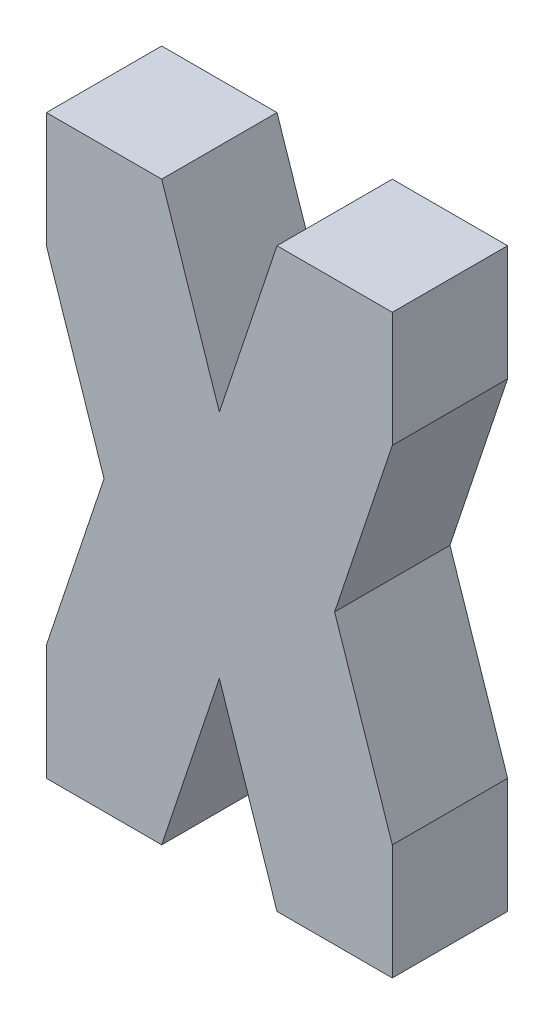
ISO-10303-21;
HEADER;
FILE_DESCRIPTION(('STEP AP214'),'2;1');
FILE_NAME('part.step','',(''),(''),'','','');
FILE_SCHEMA(('AUTOMOTIVE_DESIGN { 1 0 10303 214 1 1 1 1 }'));
ENDSEC;
DATA;
#1=APPLICATION_CONTEXT('core data for automotive mechanical design processes');
#2=APPLICATION_PROTOCOL_DEFINITION('international standard','automotive_design',2000,#1);
#3=PRODUCT_CONTEXT('',#1,'mechanical');
#4=PRODUCT('Part','Part','',(#3));
#5=PRODUCT_RELATED_PRODUCT_CATEGORY('part','',(#4));
#6=PRODUCT_DEFINITION_FORMATION('','',#4);
#7=PRODUCT_DEFINITION_CONTEXT('part definition',#1,'design');
#8=PRODUCT_DEFINITION('design','',#6,#7);
#9=PRODUCT_DEFINITION_SHAPE('','',#8);
#10=(LENGTH_UNIT() NAMED_UNIT(*) SI_UNIT(.MILLI.,.METRE.));
#11=(NAMED_UNIT(*) PLANE_ANGLE_UNIT() SI_UNIT($,.RADIAN.));
#12=(NAMED_UNIT(*) SI_UNIT($,.STERADIAN.) SOLID_ANGLE_UNIT());
#13=UNCERTAINTY_MEASURE_WITH_UNIT(LENGTH_MEASURE(1.E-05),#10,'distance_accuracy_value','');
#14=(GEOMETRIC_REPRESENTATION_CONTEXT(3) GLOBAL_UNCERTAINTY_ASSIGNED_CONTEXT((#13)) GLOBAL_UNIT_ASSIGNED_CONTEXT((#10,
#11,#12)) REPRESENTATION_CONTEXT('',''));
#15=CARTESIAN_POINT('',(0.,0.,0.));
#16=DIRECTION('',(0.,0.,1.));
#17=DIRECTION('',(1.,0.,0.));
#18=AXIS2_PLACEMENT_3D('',#15,#16,#17);
#19=CARTESIAN_POINT('',(0.,0.,10.));
#20=DIRECTION('',(1.,0.,0.));
#21=DIRECTION('',(0.,0.,-1.));
#22=AXIS2_PLACEMENT_3D('',#19,#20,#21);
#23=PLANE('',#22);
#24=DIRECTION('',(0.,-1.,0.));
#25=VECTOR('',#24,1.);
#26=CARTESIAN_POINT('',(0.,0.,0.));
#27=LINE('',#26,#25);
#28=CARTESIAN_POINT('',(0.,10.,0.));
#29=VERTEX_POINT('',#28);
#30=CARTESIAN_POINT('',(0.,0.,0.));
#31=VERTEX_POINT('',#30);
#32=EDGE_CURVE('E177',#29,#31,#27,.T.);
#33=ORIENTED_EDGE('',*,*,#32,.T.);
#34=DIRECTION('',(0.,0.,-1.));
#35=VECTOR('',#34,1.);
#36=CARTESIAN_POINT('',(0.,0.,10.));
#37=LINE('',#36,#35);
#38=CARTESIAN_POINT('',(0.,0.,10.));
#39=VERTEX_POINT('',#38);
#40=EDGE_CURVE('E11',#39,#31,#37,.T.);
#41=ORIENTED_EDGE('',*,*,#40,.F.);
#42=DIRECTION('',(0.,-1.,0.));
#43=VECTOR('',#42,1.);
#44=CARTESIAN_POINT('',(0.,0.,10.));
#45=LINE('',#44,#43);
#46=CARTESIAN_POINT('',(0.,10.,10.));
#47=VERTEX_POINT('',#46);
#48=EDGE_CURVE('E207',#47,#39,#45,.T.);
#49=ORIENTED_EDGE('',*,*,#48,.F.);
#50=DIRECTION('',(0.,0.,-1.));
#51=VECTOR('',#50,1.);
#52=CARTESIAN_POINT('',(0.,10.,10.));
#53=LINE('',#52,#51);
#54=EDGE_CURVE('E173',#47,#29,#53,.T.);
#55=ORIENTED_EDGE('',*,*,#54,.T.);
#56=EDGE_LOOP('',(#33,#41,#49,#55));
#57=FACE_BOUND('',#56,.T.);
#58=ADVANCED_FACE('F33',(#57),#23,.F.);
#59=CARTESIAN_POINT('',(0.,0.,10.));
#60=DIRECTION('',(0.,1.,0.));
#61=DIRECTION('',(0.,0.,1.));
#62=AXIS2_PLACEMENT_3D('',#59,#60,#61);
#63=PLANE('',#62);
#64=DIRECTION('',(1.,0.,0.));
#65=VECTOR('',#64,1.);
#66=CARTESIAN_POINT('',(0.,0.,0.));
#67=LINE('',#66,#65);
#68=CARTESIAN_POINT('',(10.,0.,0.));
#69=VERTEX_POINT('',#68);
#70=EDGE_CURVE('E180',#31,#69,#67,.T.);
#71=ORIENTED_EDGE('',*,*,#70,.T.);
#72=DIRECTION('',(0.,0.,-1.));
#73=VECTOR('',#72,1.);
#74=CARTESIAN_POINT('',(10.,0.,10.));
#75=LINE('',#74,#73);
#76=CARTESIAN_POINT('',(10.,0.,10.));
#77=VERTEX_POINT('',#76);
#78=EDGE_CURVE('E41',#77,#69,#75,.T.);
#79=ORIENTED_EDGE('',*,*,#78,.F.);
#80=DIRECTION('',(1.,0.,0.));
#81=VECTOR('',#80,1.);
#82=CARTESIAN_POINT('',(0.,0.,10.));
#83=LINE('',#82,#81);
#84=EDGE_CURVE('E116',#39,#77,#83,.T.);
#85=ORIENTED_EDGE('',*,*,#84,.F.);
#86=ORIENTED_EDGE('',*,*,#40,.T.);
#87=EDGE_LOOP('',(#71,#79,#85,#86));
#88=FACE_BOUND('',#87,.T.);
#89=ADVANCED_FACE('F305',(#88),#63,.F.);
#90=CARTESIAN_POINT('',(10.,0.,10.));
#91=DIRECTION('',(-0.948683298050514,0.316227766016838,0.));
#92=DIRECTION('',(-0.316227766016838,-0.948683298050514,0.));
#93=AXIS2_PLACEMENT_3D('',#90,#91,#92);
#94=PLANE('',#93);
#95=DIRECTION('',(0.316227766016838,0.948683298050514,0.));
#96=VECTOR('',#95,1.);
#97=CARTESIAN_POINT('',(10.,0.,0.));
#98=LINE('',#97,#96);
#99=CARTESIAN_POINT('',(15.,15.,0.));
#100=VERTEX_POINT('',#99);
#101=EDGE_CURVE('E182',#69,#100,#98,.T.);
#102=ORIENTED_EDGE('',*,*,#101,.T.);
#103=DIRECTION('',(0.,0.,-1.));
#104=VECTOR('',#103,1.);
#105=CARTESIAN_POINT('',(15.,15.,10.));
#106=LINE('',#105,#104);
#107=CARTESIAN_POINT('',(15.,15.,10.));
#108=VERTEX_POINT('',#107);
#109=EDGE_CURVE('E238',#108,#100,#106,.T.);
#110=ORIENTED_EDGE('',*,*,#109,.F.);
#111=DIRECTION('',(0.316227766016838,0.948683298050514,0.));
#112=VECTOR('',#111,1.);
#113=CARTESIAN_POINT('',(10.,0.,10.));
#114=LINE('',#113,#112);
#115=EDGE_CURVE('E246',#77,#108,#114,.T.);
#116=ORIENTED_EDGE('',*,*,#115,.F.);
#117=ORIENTED_EDGE('',*,*,#78,.T.);
#118=EDGE_LOOP('',(#102,#110,#116,#117));
#119=FACE_BOUND('',#118,.T.);
#120=ADVANCED_FACE('F244',(#119),#94,.F.);
#121=CARTESIAN_POINT('',(15.,15.,10.));
#122=DIRECTION('',(0.948683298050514,0.316227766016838,0.));
#123=DIRECTION('',(-0.316227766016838,0.948683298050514,0.));
#124=AXIS2_PLACEMENT_3D('',#121,#122,#123);
#125=PLANE('',#124);
#126=DIRECTION('',(0.316227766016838,-0.948683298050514,0.));
#127=VECTOR('',#126,1.);
#128=CARTESIAN_POINT('',(15.,15.,0.));
#129=LINE('',#128,#127);
#130=CARTESIAN_POINT('',(20.,0.,0.));
#131=VERTEX_POINT('',#130);
#132=EDGE_CURVE('E184',#100,#131,#129,.T.);
#133=ORIENTED_EDGE('',*,*,#132,.T.);
#134=DIRECTION('',(0.,0.,-1.));
#135=VECTOR('',#134,1.);
#136=CARTESIAN_POINT('',(20.,0.,10.));
#137=LINE('',#136,#135);
#138=CARTESIAN_POINT('',(20.,0.,10.));
#139=VERTEX_POINT('',#138);
#140=EDGE_CURVE('E235',#139,#131,#137,.T.);
#141=ORIENTED_EDGE('',*,*,#140,.F.);
#142=DIRECTION('',(0.316227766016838,-0.948683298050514,0.));
#143=VECTOR('',#142,1.);
#144=CARTESIAN_POINT('',(15.,15.,10.));
#145=LINE('',#144,#143);
#146=EDGE_CURVE('E264',#108,#139,#145,.T.);
#147=ORIENTED_EDGE('',*,*,#146,.F.);
#148=ORIENTED_EDGE('',*,*,#109,.T.);
#149=EDGE_LOOP('',(#133,#141,#147,#148));
#150=FACE_BOUND('',#149,.T.);
#151=ADVANCED_FACE('F255',(#150),#125,.F.);
#152=CARTESIAN_POINT('',(20.,0.,10.));
#153=DIRECTION('',(0.,1.,0.));
#154=DIRECTION('',(0.,0.,1.));
#155=AXIS2_PLACEMENT_3D('',#152,#153,#154);
#156=PLANE('',#155);
#157=DIRECTION('',(1.,0.,0.));
#158=VECTOR('',#157,1.);
#159=CARTESIAN_POINT('',(20.,0.,0.));
#160=LINE('',#159,#158);
#161=CARTESIAN_POINT('',(30.,0.,0.));
#162=VERTEX_POINT('',#161);
#163=EDGE_CURVE('E186',#131,#162,#160,.T.);
#164=ORIENTED_EDGE('',*,*,#163,.T.);
#165=DIRECTION('',(0.,0.,-1.));
#166=VECTOR('',#165,1.);
#167=CARTESIAN_POINT('',(30.,0.,10.));
#168=LINE('',#167,#166);
#169=CARTESIAN_POINT('',(30.,0.,10.));
#170=VERTEX_POINT('',#169);
#171=EDGE_CURVE('E232',#170,#162,#168,.T.);
#172=ORIENTED_EDGE('',*,*,#171,.F.);
#173=DIRECTION('',(1.,0.,0.));
#174=VECTOR('',#173,1.);
#175=CARTESIAN_POINT('',(20.,0.,10.));
#176=LINE('',#175,#174);
#177=EDGE_CURVE('E261',#139,#170,#176,.T.);
#178=ORIENTED_EDGE('',*,*,#177,.F.);
#179=ORIENTED_EDGE('',*,*,#140,.T.);
#180=EDGE_LOOP('',(#164,#172,#178,#179));
#181=FACE_BOUND('',#180,.T.);
#182=ADVANCED_FACE('F259',(#181),#156,.F.);
#183=CARTESIAN_POINT('',(30.,0.,10.));
#184=DIRECTION('',(-1.,0.,0.));
#185=DIRECTION('',(0.,0.,1.));
#186=AXIS2_PLACEMENT_3D('',#183,#184,#185);
#187=PLANE('',#186);
#188=DIRECTION('',(0.,1.,0.));
#189=VECTOR('',#188,1.);
#190=CARTESIAN_POINT('',(30.,0.,0.));
#191=LINE('',#190,#189);
#192=CARTESIAN_POINT('',(30.,10.,0.));
#193=VERTEX_POINT('',#192);
#194=EDGE_CURVE('E188',#162,#193,#191,.T.);
#195=ORIENTED_EDGE('',*,*,#194,.T.);
#196=DIRECTION('',(0.,0.,-1.));
#197=VECTOR('',#196,1.);
#198=CARTESIAN_POINT('',(30.,10.,10.));
#199=LINE('',#198,#197);
#200=CARTESIAN_POINT('',(30.,10.,10.));
#201=VERTEX_POINT('',#200);
#202=EDGE_CURVE('E229',#201,#193,#199,.T.);
#203=ORIENTED_EDGE('',*,*,#202,.F.);
#204=DIRECTION('',(0.,1.,0.));
#205=VECTOR('',#204,1.);
#206=CARTESIAN_POINT('',(30.,0.,10.));
#207=LINE('',#206,#205);
#208=EDGE_CURVE('E263',#170,#201,#207,.T.);
#209=ORIENTED_EDGE('',*,*,#208,.F.);
#210=ORIENTED_EDGE('',*,*,#171,.T.);
#211=EDGE_LOOP('',(#195,#203,#209,#210));
#212=FACE_BOUND('',#211,.T.);
#213=ADVANCED_FACE('F318',(#212),#187,.F.);
#214=CARTESIAN_POINT('',(25.,25.,10.));
#215=DIRECTION('',(-0.948683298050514,-0.316227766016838,0.));
#216=DIRECTION('',(0.316227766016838,-0.948683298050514,0.));
#217=AXIS2_PLACEMENT_3D('',#214,#215,#216);
#218=PLANE('',#217);
#219=DIRECTION('',(-0.316227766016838,0.948683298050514,0.));
#220=VECTOR('',#219,1.);
#221=CARTESIAN_POINT('',(25.,25.,0.));
#222=LINE('',#221,#220);
#223=CARTESIAN_POINT('',(25.,25.,0.));
#224=VERTEX_POINT('',#223);
#225=EDGE_CURVE('E190',#193,#224,#222,.T.);
#226=ORIENTED_EDGE('',*,*,#225,.T.);
#227=DIRECTION('',(0.,0.,-1.));
#228=VECTOR('',#227,1.);
#229=CARTESIAN_POINT('',(25.,25.,10.));
#230=LINE('',#229,#228);
#231=CARTESIAN_POINT('',(25.,25.,10.));
#232=VERTEX_POINT('',#231);
#233=EDGE_CURVE('E226',#232,#224,#230,.T.);
#234=ORIENTED_EDGE('',*,*,#233,.F.);
#235=DIRECTION('',(-0.316227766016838,0.948683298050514,0.));
#236=VECTOR('',#235,1.);
#237=CARTESIAN_POINT('',(25.,25.,10.));
#238=LINE('',#237,#236);
#239=EDGE_CURVE('E266',#201,#232,#238,.T.);
#240=ORIENTED_EDGE('',*,*,#239,.F.);
#241=ORIENTED_EDGE('',*,*,#202,.T.);
#242=EDGE_LOOP('',(#226,#234,#240,#241));
#243=FACE_BOUND('',#242,.T.);
#244=ADVANCED_FACE('F321',(#243),#218,.F.);
#245=CARTESIAN_POINT('',(30.,40.,10.));
#246=DIRECTION('',(-0.948683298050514,0.316227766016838,0.));
#247=DIRECTION('',(-0.316227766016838,-0.948683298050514,0.));
#248=AXIS2_PLACEMENT_3D('',#245,#246,#247);
#249=PLANE('',#248);
#250=DIRECTION('',(0.316227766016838,0.948683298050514,0.));
#251=VECTOR('',#250,1.);
#252=CARTESIAN_POINT('',(30.,40.,0.));
#253=LINE('',#252,#251);
#254=CARTESIAN_POINT('',(30.,40.,0.));
#255=VERTEX_POINT('',#254);
#256=EDGE_CURVE('E192',#224,#255,#253,.T.);
#257=ORIENTED_EDGE('',*,*,#256,.T.);
#258=DIRECTION('',(0.,0.,-1.));
#259=VECTOR('',#258,1.);
#260=CARTESIAN_POINT('',(30.,40.,10.));
#261=LINE('',#260,#259);
#262=CARTESIAN_POINT('',(30.,40.,10.));
#263=VERTEX_POINT('',#262);
#264=EDGE_CURVE('E223',#263,#255,#261,.T.);
#265=ORIENTED_EDGE('',*,*,#264,.F.);
#266=DIRECTION('',(0.316227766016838,0.948683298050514,0.));
#267=VECTOR('',#266,1.);
#268=CARTESIAN_POINT('',(30.,40.,10.));
#269=LINE('',#268,#267);
#270=EDGE_CURVE('E272',#232,#263,#269,.T.);
#271=ORIENTED_EDGE('',*,*,#270,.F.);
#272=ORIENTED_EDGE('',*,*,#233,.T.);
#273=EDGE_LOOP('',(#257,#265,#271,#272));
#274=FACE_BOUND('',#273,.T.);
#275=ADVANCED_FACE('F325',(#274),#249,.F.);
#276=CARTESIAN_POINT('',(30.,40.,10.));
#277=DIRECTION('',(-1.,0.,0.));
#278=DIRECTION('',(0.,0.,1.));
#279=AXIS2_PLACEMENT_3D('',#276,#277,#278);
#280=PLANE('',#279);
#281=DIRECTION('',(0.,1.,0.));
#282=VECTOR('',#281,1.);
#283=CARTESIAN_POINT('',(30.,40.,0.));
#284=LINE('',#283,#282);
#285=CARTESIAN_POINT('',(30.,50.,0.));
#286=VERTEX_POINT('',#285);
#287=EDGE_CURVE('E194',#255,#286,#284,.T.);
#288=ORIENTED_EDGE('',*,*,#287,.T.);
#289=DIRECTION('',(0.,0.,-1.));
#290=VECTOR('',#289,1.);
#291=CARTESIAN_POINT('',(30.,50.,10.));
#292=LINE('',#291,#290);
#293=CARTESIAN_POINT('',(30.,50.,10.));
#294=VERTEX_POINT('',#293);
#295=EDGE_CURVE('E220',#294,#286,#292,.T.);
#296=ORIENTED_EDGE('',*,*,#295,.F.);
#297=DIRECTION('',(0.,1.,0.));
#298=VECTOR('',#297,1.);
#299=CARTESIAN_POINT('',(30.,40.,10.));
#300=LINE('',#299,#298);
#301=EDGE_CURVE('E274',#263,#294,#300,.T.);
#302=ORIENTED_EDGE('',*,*,#301,.F.);
#303=ORIENTED_EDGE('',*,*,#264,.T.);
#304=EDGE_LOOP('',(#288,#296,#302,#303));
#305=FACE_BOUND('',#304,.T.);
#306=ADVANCED_FACE('F329',(#305),#280,.F.);
#307=CARTESIAN_POINT('',(20.,50.,10.));
#308=DIRECTION('',(0.,-1.,0.));
#309=DIRECTION('',(0.,0.,-1.));
#310=AXIS2_PLACEMENT_3D('',#307,#308,#309);
#311=PLANE('',#310);
#312=DIRECTION('',(-1.,0.,0.));
#313=VECTOR('',#312,1.);
#314=CARTESIAN_POINT('',(20.,50.,0.));
#315=LINE('',#314,#313);
#316=CARTESIAN_POINT('',(20.,50.,0.));
#317=VERTEX_POINT('',#316);
#318=EDGE_CURVE('E196',#286,#317,#315,.T.);
#319=ORIENTED_EDGE('',*,*,#318,.T.);
#320=DIRECTION('',(0.,0.,-1.));
#321=VECTOR('',#320,1.);
#322=CARTESIAN_POINT('',(20.,50.,10.));
#323=LINE('',#322,#321);
#324=CARTESIAN_POINT('',(20.,50.,10.));
#325=VERTEX_POINT('',#324);
#326=EDGE_CURVE('E217',#325,#317,#323,.T.);
#327=ORIENTED_EDGE('',*,*,#326,.F.);
#328=DIRECTION('',(-1.,0.,0.));
#329=VECTOR('',#328,1.);
#330=CARTESIAN_POINT('',(20.,50.,10.));
#331=LINE('',#330,#329);
#332=EDGE_CURVE('E276',#294,#325,#331,.T.);
#333=ORIENTED_EDGE('',*,*,#332,.F.);
#334=ORIENTED_EDGE('',*,*,#295,.T.);
#335=EDGE_LOOP('',(#319,#327,#333,#334));
#336=FACE_BOUND('',#335,.T.);
#337=ADVANCED_FACE('F333',(#336),#311,.F.);
#338=CARTESIAN_POINT('',(15.,35.,10.));
#339=DIRECTION('',(0.948683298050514,-0.316227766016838,0.));
#340=DIRECTION('',(0.316227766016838,0.948683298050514,0.));
#341=AXIS2_PLACEMENT_3D('',#338,#339,#340);
#342=PLANE('',#341);
#343=DIRECTION('',(-0.316227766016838,-0.948683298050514,0.));
#344=VECTOR('',#343,1.);
#345=CARTESIAN_POINT('',(15.,35.,0.));
#346=LINE('',#345,#344);
#347=CARTESIAN_POINT('',(15.,35.,0.));
#348=VERTEX_POINT('',#347);
#349=EDGE_CURVE('E198',#317,#348,#346,.T.);
#350=ORIENTED_EDGE('',*,*,#349,.T.);
#351=DIRECTION('',(0.,0.,-1.));
#352=VECTOR('',#351,1.);
#353=CARTESIAN_POINT('',(15.,35.,10.));
#354=LINE('',#353,#352);
#355=CARTESIAN_POINT('',(15.,35.,10.));
#356=VERTEX_POINT('',#355);
#357=EDGE_CURVE('E214',#356,#348,#354,.T.);
#358=ORIENTED_EDGE('',*,*,#357,.F.);
#359=DIRECTION('',(-0.316227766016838,-0.948683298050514,0.));
#360=VECTOR('',#359,1.);
#361=CARTESIAN_POINT('',(15.,35.,10.));
#362=LINE('',#361,#360);
#363=EDGE_CURVE('E278',#325,#356,#362,.T.);
#364=ORIENTED_EDGE('',*,*,#363,.F.);
#365=ORIENTED_EDGE('',*,*,#326,.T.);
#366=EDGE_LOOP('',(#350,#358,#364,#365));
#367=FACE_BOUND('',#366,.T.);
#368=ADVANCED_FACE('F337',(#367),#342,.F.);
#369=CARTESIAN_POINT('',(10.,50.,10.));
#370=DIRECTION('',(-0.948683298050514,-0.316227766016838,0.));
#371=DIRECTION('',(0.316227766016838,-0.948683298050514,0.));
#372=AXIS2_PLACEMENT_3D('',#369,#370,#371);
#373=PLANE('',#372);
#374=DIRECTION('',(-0.316227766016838,0.948683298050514,0.));
#375=VECTOR('',#374,1.);
#376=CARTESIAN_POINT('',(10.,50.,0.));
#377=LINE('',#376,#375);
#378=CARTESIAN_POINT('',(10.,50.,0.));
#379=VERTEX_POINT('',#378);
#380=EDGE_CURVE('E200',#348,#379,#377,.T.);
#381=ORIENTED_EDGE('',*,*,#380,.T.);
#382=DIRECTION('',(0.,0.,-1.));
#383=VECTOR('',#382,1.);
#384=CARTESIAN_POINT('',(10.,50.,10.));
#385=LINE('',#384,#383);
#386=CARTESIAN_POINT('',(10.,50.,10.));
#387=VERTEX_POINT('',#386);
#388=EDGE_CURVE('E211',#387,#379,#385,.T.);
#389=ORIENTED_EDGE('',*,*,#388,.F.);
#390=DIRECTION('',(-0.316227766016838,0.948683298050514,0.));
#391=VECTOR('',#390,1.);
#392=CARTESIAN_POINT('',(10.,50.,10.));
#393=LINE('',#392,#391);
#394=EDGE_CURVE('E280',#356,#387,#393,.T.);
#395=ORIENTED_EDGE('',*,*,#394,.F.);
#396=ORIENTED_EDGE('',*,*,#357,.T.);
#397=EDGE_LOOP('',(#381,#389,#395,#396));
#398=FACE_BOUND('',#397,.T.);
#399=ADVANCED_FACE('F286',(#398),#373,.F.);
#400=CARTESIAN_POINT('',(0.,50.,10.));
#401=DIRECTION('',(0.,-1.,0.));
#402=DIRECTION('',(0.,0.,-1.));
#403=AXIS2_PLACEMENT_3D('',#400,#401,#402);
#404=PLANE('',#403);
#405=DIRECTION('',(-1.,0.,0.));
#406=VECTOR('',#405,1.);
#407=CARTESIAN_POINT('',(0.,50.,0.));
#408=LINE('',#407,#406);
#409=CARTESIAN_POINT('',(0.,50.,0.));
#410=VERTEX_POINT('',#409);
#411=EDGE_CURVE('E202',#379,#410,#408,.T.);
#412=ORIENTED_EDGE('',*,*,#411,.T.);
#413=DIRECTION('',(0.,0.,-1.));
#414=VECTOR('',#413,1.);
#415=CARTESIAN_POINT('',(0.,50.,10.));
#416=LINE('',#415,#414);
#417=CARTESIAN_POINT('',(0.,50.,10.));
#418=VERTEX_POINT('',#417);
#419=EDGE_CURVE('E168',#418,#410,#416,.T.);
#420=ORIENTED_EDGE('',*,*,#419,.F.);
#421=DIRECTION('',(-1.,0.,0.));
#422=VECTOR('',#421,1.);
#423=CARTESIAN_POINT('',(0.,50.,10.));
#424=LINE('',#423,#422);
#425=EDGE_CURVE('E159',#387,#418,#424,.T.);
#426=ORIENTED_EDGE('',*,*,#425,.F.);
#427=ORIENTED_EDGE('',*,*,#388,.T.);
#428=EDGE_LOOP('',(#412,#420,#426,#427));
#429=FACE_BOUND('',#428,.T.);
#430=ADVANCED_FACE('F290',(#429),#404,.F.);
#431=CARTESIAN_POINT('',(0.,40.,10.));
#432=DIRECTION('',(1.,0.,0.));
#433=DIRECTION('',(0.,0.,-1.));
#434=AXIS2_PLACEMENT_3D('',#431,#432,#433);
#435=PLANE('',#434);
#436=DIRECTION('',(0.,-1.,0.));
#437=VECTOR('',#436,1.);
#438=CARTESIAN_POINT('',(0.,40.,0.));
#439=LINE('',#438,#437);
#440=CARTESIAN_POINT('',(0.,40.,0.));
#441=VERTEX_POINT('',#440);
#442=EDGE_CURVE('E167',#410,#441,#439,.T.);
#443=ORIENTED_EDGE('',*,*,#442,.T.);
#444=DIRECTION('',(0.,0.,-1.));
#445=VECTOR('',#444,1.);
#446=CARTESIAN_POINT('',(0.,40.,10.));
#447=LINE('',#446,#445);
#448=CARTESIAN_POINT('',(0.,40.,10.));
#449=VERTEX_POINT('',#448);
#450=EDGE_CURVE('E164',#449,#441,#447,.T.);
#451=ORIENTED_EDGE('',*,*,#450,.F.);
#452=DIRECTION('',(0.,-1.,0.));
#453=VECTOR('',#452,1.);
#454=CARTESIAN_POINT('',(0.,40.,10.));
#455=LINE('',#454,#453);
#456=EDGE_CURVE('E153',#418,#449,#455,.T.);
#457=ORIENTED_EDGE('',*,*,#456,.F.);
#458=ORIENTED_EDGE('',*,*,#419,.T.);
#459=EDGE_LOOP('',(#443,#451,#457,#458));
#460=FACE_BOUND('',#459,.T.);
#461=ADVANCED_FACE('F165',(#460),#435,.F.);
#462=CARTESIAN_POINT('',(0.,40.,10.));
#463=DIRECTION('',(0.948683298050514,0.316227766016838,0.));
#464=DIRECTION('',(-0.316227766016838,0.948683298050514,0.));
#465=AXIS2_PLACEMENT_3D('',#462,#463,#464);
#466=PLANE('',#465);
#467=DIRECTION('',(0.316227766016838,-0.948683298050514,0.));
#468=VECTOR('',#467,1.);
#469=CARTESIAN_POINT('',(0.,40.,0.));
#470=LINE('',#469,#468);
#471=CARTESIAN_POINT('',(5.,25.,0.));
#472=VERTEX_POINT('',#471);
#473=EDGE_CURVE('E102',#441,#472,#470,.T.);
#474=ORIENTED_EDGE('',*,*,#473,.T.);
#475=DIRECTION('',(0.,0.,-1.));
#476=VECTOR('',#475,1.);
#477=CARTESIAN_POINT('',(5.,25.,10.));
#478=LINE('',#477,#476);
#479=CARTESIAN_POINT('',(5.,25.,10.));
#480=VERTEX_POINT('',#479);
#481=EDGE_CURVE('E169',#480,#472,#478,.T.);
#482=ORIENTED_EDGE('',*,*,#481,.F.);
#483=DIRECTION('',(0.316227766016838,-0.948683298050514,0.));
#484=VECTOR('',#483,1.);
#485=CARTESIAN_POINT('',(0.,40.,10.));
#486=LINE('',#485,#484);
#487=EDGE_CURVE('E157',#449,#480,#486,.T.);
#488=ORIENTED_EDGE('',*,*,#487,.F.);
#489=ORIENTED_EDGE('',*,*,#450,.T.);
#490=EDGE_LOOP('',(#474,#482,#488,#489));
#491=FACE_BOUND('',#490,.T.);
#492=ADVANCED_FACE('F171',(#491),#466,.F.);
#493=CARTESIAN_POINT('',(5.,25.,10.));
#494=DIRECTION('',(0.948683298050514,-0.316227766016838,0.));
#495=DIRECTION('',(0.316227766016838,0.948683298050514,0.));
#496=AXIS2_PLACEMENT_3D('',#493,#494,#495);
#497=PLANE('',#496);
#498=DIRECTION('',(-0.316227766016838,-0.948683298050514,0.));
#499=VECTOR('',#498,1.);
#500=CARTESIAN_POINT('',(5.,25.,0.));
#501=LINE('',#500,#499);
#502=EDGE_CURVE('E108',#472,#29,#501,.T.);
#503=ORIENTED_EDGE('',*,*,#502,.T.);
#504=ORIENTED_EDGE('',*,*,#54,.F.);
#505=DIRECTION('',(-0.316227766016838,-0.948683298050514,0.));
#506=VECTOR('',#505,1.);
#507=CARTESIAN_POINT('',(5.,25.,10.));
#508=LINE('',#507,#506);
#509=EDGE_CURVE('E49',#480,#47,#508,.T.);
#510=ORIENTED_EDGE('',*,*,#509,.F.);
#511=ORIENTED_EDGE('',*,*,#481,.T.);
#512=EDGE_LOOP('',(#503,#504,#510,#511));
#513=FACE_BOUND('',#512,.T.);
#514=ADVANCED_FACE('F294',(#513),#497,.F.);
#515=CARTESIAN_POINT('',(0.,0.,10.));
#516=DIRECTION('',(0.,0.,-1.));
#517=DIRECTION('',(-1.,0.,0.));
#518=AXIS2_PLACEMENT_3D('',#515,#516,#517);
#519=PLANE('',#518);
#520=ORIENTED_EDGE('',*,*,#48,.T.);
#521=ORIENTED_EDGE('',*,*,#84,.T.);
#522=ORIENTED_EDGE('',*,*,#115,.T.);
#523=ORIENTED_EDGE('',*,*,#146,.T.);
#524=ORIENTED_EDGE('',*,*,#177,.T.);
#525=ORIENTED_EDGE('',*,*,#208,.T.);
#526=ORIENTED_EDGE('',*,*,#239,.T.);
#527=ORIENTED_EDGE('',*,*,#270,.T.);
#528=ORIENTED_EDGE('',*,*,#301,.T.);
#529=ORIENTED_EDGE('',*,*,#332,.T.);
#530=ORIENTED_EDGE('',*,*,#363,.T.);
#531=ORIENTED_EDGE('',*,*,#394,.T.);
#532=ORIENTED_EDGE('',*,*,#425,.T.);
#533=ORIENTED_EDGE('',*,*,#456,.T.);
#534=ORIENTED_EDGE('',*,*,#487,.T.);
#535=ORIENTED_EDGE('',*,*,#509,.T.);
#536=EDGE_LOOP('',(#520,#521,#522,#523,#524,#525,#526,#527,#528,#529,#530,#531,#532,#533,#534,#535));
#537=FACE_BOUND('',#536,.T.);
#538=ADVANCED_FACE('F155',(#537),#519,.F.);
#539=CARTESIAN_POINT('',(0.,0.,0.));
#540=DIRECTION('',(0.,0.,-1.));
#541=DIRECTION('',(-1.,0.,0.));
#542=AXIS2_PLACEMENT_3D('',#539,#540,#541);
#543=PLANE('',#542);
#544=ORIENTED_EDGE('',*,*,#32,.F.);
#545=ORIENTED_EDGE('',*,*,#502,.F.);
#546=ORIENTED_EDGE('',*,*,#473,.F.);
#547=ORIENTED_EDGE('',*,*,#442,.F.);
#548=ORIENTED_EDGE('',*,*,#411,.F.);
#549=ORIENTED_EDGE('',*,*,#380,.F.);
#550=ORIENTED_EDGE('',*,*,#349,.F.);
#551=ORIENTED_EDGE('',*,*,#318,.F.);
#552=ORIENTED_EDGE('',*,*,#287,.F.);
#553=ORIENTED_EDGE('',*,*,#256,.F.);
#554=ORIENTED_EDGE('',*,*,#225,.F.);
#555=ORIENTED_EDGE('',*,*,#194,.F.);
#556=ORIENTED_EDGE('',*,*,#163,.F.);
#557=ORIENTED_EDGE('',*,*,#132,.F.);
#558=ORIENTED_EDGE('',*,*,#101,.F.);
#559=ORIENTED_EDGE('',*,*,#70,.F.);
#560=EDGE_LOOP('',(#544,#545,#546,#547,#548,#549,#550,#551,#552,#553,#554,#555,#556,#557,#558,#559));
#561=FACE_BOUND('',#560,.T.);
#562=ADVANCED_FACE('F250',(#561),#543,.T.);
#563=CLOSED_SHELL('',(#58,#89,#120,#151,#182,#213,#244,#275,#306,#337,#368,#399,#430,#461,#492,
#514,#538,#562));
#564=MANIFOLD_SOLID_BREP('B2',#563);
#565=ADVANCED_BREP_SHAPE_REPRESENTATION('',(#18,#564),#14);
#566=SHAPE_DEFINITION_REPRESENTATION(#9,#565);
ENDSEC;
END-ISO-10303-21;
